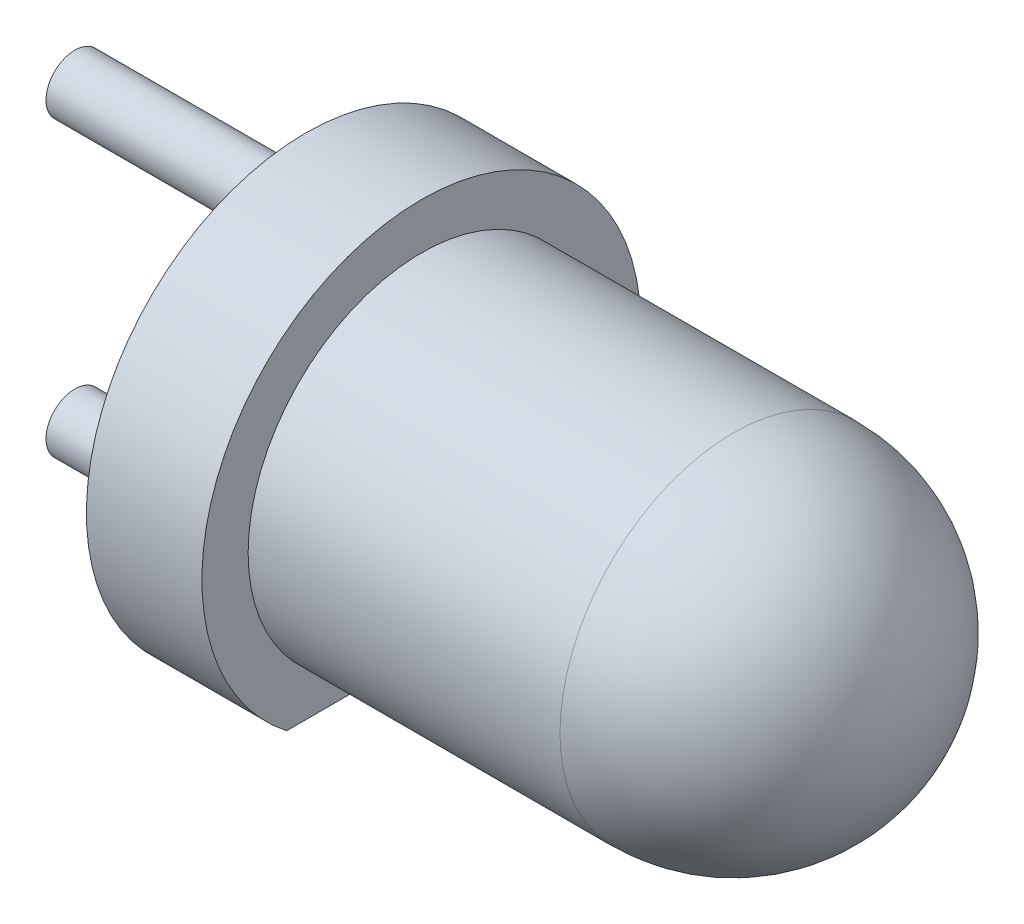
ISO-10303-21;
HEADER;
FILE_DESCRIPTION(('STEP AP214'),'2;1');
FILE_NAME('part.step','',(''),(''),'','','');
FILE_SCHEMA(('AUTOMOTIVE_DESIGN { 1 0 10303 214 1 1 1 1 }'));
ENDSEC;
DATA;
#1=APPLICATION_CONTEXT('core data for automotive mechanical design processes');
#2=APPLICATION_PROTOCOL_DEFINITION('international standard','automotive_design',2000,#1);
#3=PRODUCT_CONTEXT('',#1,'mechanical');
#4=PRODUCT('Part','Part','',(#3));
#5=PRODUCT_RELATED_PRODUCT_CATEGORY('part','',(#4));
#6=PRODUCT_DEFINITION_FORMATION('','',#4);
#7=PRODUCT_DEFINITION_CONTEXT('part definition',#1,'design');
#8=PRODUCT_DEFINITION('design','',#6,#7);
#9=PRODUCT_DEFINITION_SHAPE('','',#8);
#10=(LENGTH_UNIT() NAMED_UNIT(*) SI_UNIT(.MILLI.,.METRE.));
#11=(NAMED_UNIT(*) PLANE_ANGLE_UNIT() SI_UNIT($,.RADIAN.));
#12=(NAMED_UNIT(*) SI_UNIT($,.STERADIAN.) SOLID_ANGLE_UNIT());
#13=UNCERTAINTY_MEASURE_WITH_UNIT(LENGTH_MEASURE(1.E-05),#10,'distance_accuracy_value','');
#14=(GEOMETRIC_REPRESENTATION_CONTEXT(3) GLOBAL_UNCERTAINTY_ASSIGNED_CONTEXT((#13)) GLOBAL_UNIT_ASSIGNED_CONTEXT((#10,
#11,#12)) REPRESENTATION_CONTEXT('',''));
#15=CARTESIAN_POINT('',(0.,0.,0.));
#16=DIRECTION('',(0.,0.,1.));
#17=DIRECTION('',(1.,0.,0.));
#18=AXIS2_PLACEMENT_3D('',#15,#16,#17);
#19=CARTESIAN_POINT('',(-1.,0.,0.));
#20=DIRECTION('',(1.,0.,0.));
#21=DIRECTION('',(0.,0.,-1.));
#22=AXIS2_PLACEMENT_3D('',#19,#20,#21);
#23=PLANE('',#22);
#24=CARTESIAN_POINT('',(-1.,1.27,0.));
#25=DIRECTION('',(1.,0.,0.));
#26=DIRECTION('',(0.,0.,-1.));
#27=AXIS2_PLACEMENT_3D('',#24,#25,#26);
#28=CIRCLE('',#27,0.25);
#29=CARTESIAN_POINT('',(-1.,1.27,-0.25));
#30=VERTEX_POINT('',#29);
#31=EDGE_CURVE('E95',#30,#30,#28,.F.);
#32=ORIENTED_EDGE('',*,*,#31,.F.);
#33=EDGE_LOOP('',(#32));
#34=FACE_BOUND('',#33,.T.);
#35=CARTESIAN_POINT('',(-1.,0.,0.));
#36=DIRECTION('',(-1.,0.,0.));
#37=DIRECTION('',(0.,0.,1.));
#38=AXIS2_PLACEMENT_3D('',#35,#36,#37);
#39=CIRCLE('',#38,1.9);
#40=CARTESIAN_POINT('',(-1.,-1.5,1.16619037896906));
#41=VERTEX_POINT('',#40);
#42=CARTESIAN_POINT('',(-1.,-1.5,-1.16619037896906));
#43=VERTEX_POINT('',#42);
#44=EDGE_CURVE('E72',#41,#43,#39,.T.);
#45=ORIENTED_EDGE('',*,*,#44,.T.);
#46=DIRECTION('',(0.,0.,-1.));
#47=VECTOR('',#46,1.);
#48=CARTESIAN_POINT('',(-1.,-1.5,-1.86706033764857));
#49=LINE('',#48,#47);
#50=CARTESIAN_POINT('',(-1.,-1.5,-0.0979795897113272));
#51=VERTEX_POINT('',#50);
#52=EDGE_CURVE('E78',#51,#43,#49,.T.);
#53=ORIENTED_EDGE('',*,*,#52,.F.);
#54=CARTESIAN_POINT('',(-1.,-1.27,0.));
#55=DIRECTION('',(1.,0.,0.));
#56=DIRECTION('',(0.,0.,-1.));
#57=AXIS2_PLACEMENT_3D('',#54,#55,#56);
#58=CIRCLE('',#57,0.25);
#59=CARTESIAN_POINT('',(-1.,-1.5,0.0979795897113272));
#60=VERTEX_POINT('',#59);
#61=EDGE_CURVE('E74',#60,#51,#58,.F.);
#62=ORIENTED_EDGE('',*,*,#61,.F.);
#63=EDGE_CURVE('E41',#41,#60,#49,.T.);
#64=ORIENTED_EDGE('',*,*,#63,.F.);
#65=EDGE_LOOP('',(#45,#53,#62,#64));
#66=FACE_BOUND('',#65,.T.);
#67=ADVANCED_FACE('F27',(#34,#66),#23,.F.);
#68=CARTESIAN_POINT('',(2.7,0.,0.));
#69=DIRECTION('',(-1.,0.,0.));
#70=DIRECTION('',(0.,1.,0.));
#71=AXIS2_PLACEMENT_3D('',#68,#69,#70);
#72=SPHERICAL_SURFACE('',#71,1.5);
#73=CARTESIAN_POINT('',(2.7,0.,0.));
#74=DIRECTION('',(-1.,0.,0.));
#75=DIRECTION('',(0.,0.,1.));
#76=AXIS2_PLACEMENT_3D('',#73,#74,#75);
#77=CIRCLE('',#76,1.5);
#78=CARTESIAN_POINT('',(2.7,0.,1.5));
#79=VERTEX_POINT('',#78);
#80=EDGE_CURVE('E92',#79,#79,#77,.T.);
#81=ORIENTED_EDGE('',*,*,#80,.F.);
#82=EDGE_LOOP('',(#81));
#83=FACE_BOUND('',#82,.T.);
#84=ADVANCED_FACE('F118',(#83),#72,.T.);
#85=CARTESIAN_POINT('',(0.,0.,0.));
#86=DIRECTION('',(-1.,0.,0.));
#87=DIRECTION('',(0.,0.,1.));
#88=AXIS2_PLACEMENT_3D('',#85,#86,#87);
#89=CYLINDRICAL_SURFACE('',#88,1.5);
#90=CARTESIAN_POINT('',(0.,0.,0.));
#91=DIRECTION('',(-1.,0.,0.));
#92=DIRECTION('',(0.,0.,1.));
#93=AXIS2_PLACEMENT_3D('',#90,#91,#92);
#94=CIRCLE('',#93,1.5);
#95=CARTESIAN_POINT('',(0.,-1.5,0.));
#96=VERTEX_POINT('',#95);
#97=EDGE_CURVE('E83',#96,#96,#94,.T.);
#98=ORIENTED_EDGE('',*,*,#97,.F.);
#99=EDGE_LOOP('',(#98));
#100=FACE_BOUND('',#99,.T.);
#101=ORIENTED_EDGE('',*,*,#80,.T.);
#102=EDGE_LOOP('',(#101));
#103=FACE_BOUND('',#102,.T.);
#104=ADVANCED_FACE('F123',(#100,#103),#89,.T.);
#105=CARTESIAN_POINT('',(0.,1.5,0.));
#106=DIRECTION('',(-1.,0.,0.));
#107=DIRECTION('',(0.,0.,1.));
#108=AXIS2_PLACEMENT_3D('',#105,#106,#107);
#109=PLANE('',#108);
#110=CARTESIAN_POINT('',(0.,0.,0.));
#111=DIRECTION('',(-1.,0.,0.));
#112=DIRECTION('',(0.,0.,1.));
#113=AXIS2_PLACEMENT_3D('',#110,#111,#112);
#114=CIRCLE('',#113,1.9);
#115=CARTESIAN_POINT('',(0.,-1.5,1.16619037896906));
#116=VERTEX_POINT('',#115);
#117=CARTESIAN_POINT('',(0.,-1.5,-1.16619037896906));
#118=VERTEX_POINT('',#117);
#119=EDGE_CURVE('E80',#116,#118,#114,.T.);
#120=ORIENTED_EDGE('',*,*,#119,.F.);
#121=DIRECTION('',(0.,0.,-1.));
#122=VECTOR('',#121,1.);
#123=CARTESIAN_POINT('',(0.,-1.5,0.));
#124=LINE('',#123,#122);
#125=EDGE_CURVE('E62',#116,#96,#124,.T.);
#126=ORIENTED_EDGE('',*,*,#125,.T.);
#127=ORIENTED_EDGE('',*,*,#97,.T.);
#128=EDGE_CURVE('E146',#96,#118,#124,.T.);
#129=ORIENTED_EDGE('',*,*,#128,.T.);
#130=EDGE_LOOP('',(#120,#126,#127,#129));
#131=FACE_BOUND('',#130,.T.);
#132=ADVANCED_FACE('F132',(#131),#109,.F.);
#133=CARTESIAN_POINT('',(0.,0.,0.));
#134=DIRECTION('',(-1.,0.,0.));
#135=DIRECTION('',(0.,0.,1.));
#136=AXIS2_PLACEMENT_3D('',#133,#134,#135);
#137=CYLINDRICAL_SURFACE('',#136,1.9);
#138=ORIENTED_EDGE('',*,*,#119,.T.);
#139=DIRECTION('',(-1.,0.,0.));
#140=VECTOR('',#139,1.);
#141=CARTESIAN_POINT('',(0.,-1.5,-1.16619037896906));
#142=LINE('',#141,#140);
#143=EDGE_CURVE('E11',#118,#43,#142,.T.);
#144=ORIENTED_EDGE('',*,*,#143,.T.);
#145=ORIENTED_EDGE('',*,*,#44,.F.);
#146=DIRECTION('',(-1.,0.,0.));
#147=VECTOR('',#146,1.);
#148=CARTESIAN_POINT('',(0.,-1.5,1.16619037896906));
#149=LINE('',#148,#147);
#150=EDGE_CURVE('E34',#41,#116,#149,.F.);
#151=ORIENTED_EDGE('',*,*,#150,.T.);
#152=EDGE_LOOP('',(#138,#144,#145,#151));
#153=FACE_BOUND('',#152,.T.);
#154=ADVANCED_FACE('F79',(#153),#137,.T.);
#155=CARTESIAN_POINT('',(-3.,1.27,0.));
#156=DIRECTION('',(1.,0.,0.));
#157=DIRECTION('',(0.,0.,-1.));
#158=AXIS2_PLACEMENT_3D('',#155,#156,#157);
#159=CYLINDRICAL_SURFACE('',#158,0.25);
#160=CARTESIAN_POINT('',(-3.,1.27,0.));
#161=DIRECTION('',(-1.,0.,0.));
#162=DIRECTION('',(0.,0.,1.));
#163=AXIS2_PLACEMENT_3D('',#160,#161,#162);
#164=CIRCLE('',#163,0.25);
#165=CARTESIAN_POINT('',(-3.,1.27,0.25));
#166=VERTEX_POINT('',#165);
#167=EDGE_CURVE('E81',#166,#166,#164,.T.);
#168=ORIENTED_EDGE('',*,*,#167,.F.);
#169=EDGE_LOOP('',(#168));
#170=FACE_BOUND('',#169,.T.);
#171=ORIENTED_EDGE('',*,*,#31,.T.);
#172=EDGE_LOOP('',(#171));
#173=FACE_BOUND('',#172,.T.);
#174=ADVANCED_FACE('F113',(#170,#173),#159,.T.);
#175=CARTESIAN_POINT('',(-3.,1.27,0.));
#176=DIRECTION('',(-1.,0.,0.));
#177=DIRECTION('',(0.,0.,1.));
#178=AXIS2_PLACEMENT_3D('',#175,#176,#177);
#179=PLANE('',#178);
#180=ORIENTED_EDGE('',*,*,#167,.T.);
#181=EDGE_LOOP('',(#180));
#182=FACE_BOUND('',#181,.T.);
#183=ADVANCED_FACE('F102',(#182),#179,.T.);
#184=CARTESIAN_POINT('',(-3.,-1.27,0.));
#185=DIRECTION('',(1.,0.,0.));
#186=DIRECTION('',(0.,0.,-1.));
#187=AXIS2_PLACEMENT_3D('',#184,#185,#186);
#188=CYLINDRICAL_SURFACE('',#187,0.25);
#189=CARTESIAN_POINT('',(-3.,-1.27,0.));
#190=DIRECTION('',(-1.,0.,0.));
#191=DIRECTION('',(0.,0.,1.));
#192=AXIS2_PLACEMENT_3D('',#189,#190,#191);
#193=CIRCLE('',#192,0.25);
#194=CARTESIAN_POINT('',(-3.,-1.27,0.25));
#195=VERTEX_POINT('',#194);
#196=EDGE_CURVE('E86',#195,#195,#193,.T.);
#197=ORIENTED_EDGE('',*,*,#196,.F.);
#198=EDGE_LOOP('',(#197));
#199=FACE_BOUND('',#198,.T.);
#200=EDGE_CURVE('E67',#51,#60,#58,.F.);
#201=ORIENTED_EDGE('',*,*,#200,.T.);
#202=ORIENTED_EDGE('',*,*,#61,.T.);
#203=EDGE_LOOP('',(#201,#202));
#204=FACE_BOUND('',#203,.T.);
#205=ADVANCED_FACE('F99',(#199,#204),#188,.T.);
#206=CARTESIAN_POINT('',(-3.,-1.27,0.));
#207=DIRECTION('',(-1.,0.,0.));
#208=DIRECTION('',(0.,0.,1.));
#209=AXIS2_PLACEMENT_3D('',#206,#207,#208);
#210=PLANE('',#209);
#211=ORIENTED_EDGE('',*,*,#196,.T.);
#212=EDGE_LOOP('',(#211));
#213=FACE_BOUND('',#212,.T.);
#214=ADVANCED_FACE('F101',(#213),#210,.T.);
#215=CARTESIAN_POINT('',(9.,-1.5,-1.86706033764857));
#216=DIRECTION('',(0.,1.,0.));
#217=DIRECTION('',(0.,0.,1.));
#218=AXIS2_PLACEMENT_3D('',#215,#216,#217);
#219=PLANE('',#218);
#220=ORIENTED_EDGE('',*,*,#125,.F.);
#221=ORIENTED_EDGE('',*,*,#150,.F.);
#222=ORIENTED_EDGE('',*,*,#63,.T.);
#223=EDGE_CURVE('E76',#60,#51,#49,.T.);
#224=ORIENTED_EDGE('',*,*,#223,.T.);
#225=ORIENTED_EDGE('',*,*,#52,.T.);
#226=ORIENTED_EDGE('',*,*,#143,.F.);
#227=ORIENTED_EDGE('',*,*,#128,.F.);
#228=EDGE_LOOP('',(#220,#221,#222,#224,#225,#226,#227));
#229=FACE_BOUND('',#228,.T.);
#230=ADVANCED_FACE('F60',(#229),#219,.F.);
#231=CARTESIAN_POINT('',(-1.,-2.21728871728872,-1.86706033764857));
#232=DIRECTION('',(-1.,0.,0.));
#233=DIRECTION('',(0.,0.,1.));
#234=AXIS2_PLACEMENT_3D('',#231,#232,#233);
#235=PLANE('',#234);
#236=ORIENTED_EDGE('',*,*,#223,.F.);
#237=ORIENTED_EDGE('',*,*,#200,.F.);
#238=EDGE_LOOP('',(#236,#237));
#239=FACE_BOUND('',#238,.T.);
#240=ADVANCED_FACE('F150',(#239),#235,.F.);
#241=CLOSED_SHELL('',(#67,#84,#104,#132,#154,#174,#183,#205,#214,#230,#240));
#242=MANIFOLD_SOLID_BREP('B2',#241);
#243=ADVANCED_BREP_SHAPE_REPRESENTATION('',(#18,#242),#14);
#244=SHAPE_DEFINITION_REPRESENTATION(#9,#243);
ENDSEC;
END-ISO-10303-21;
